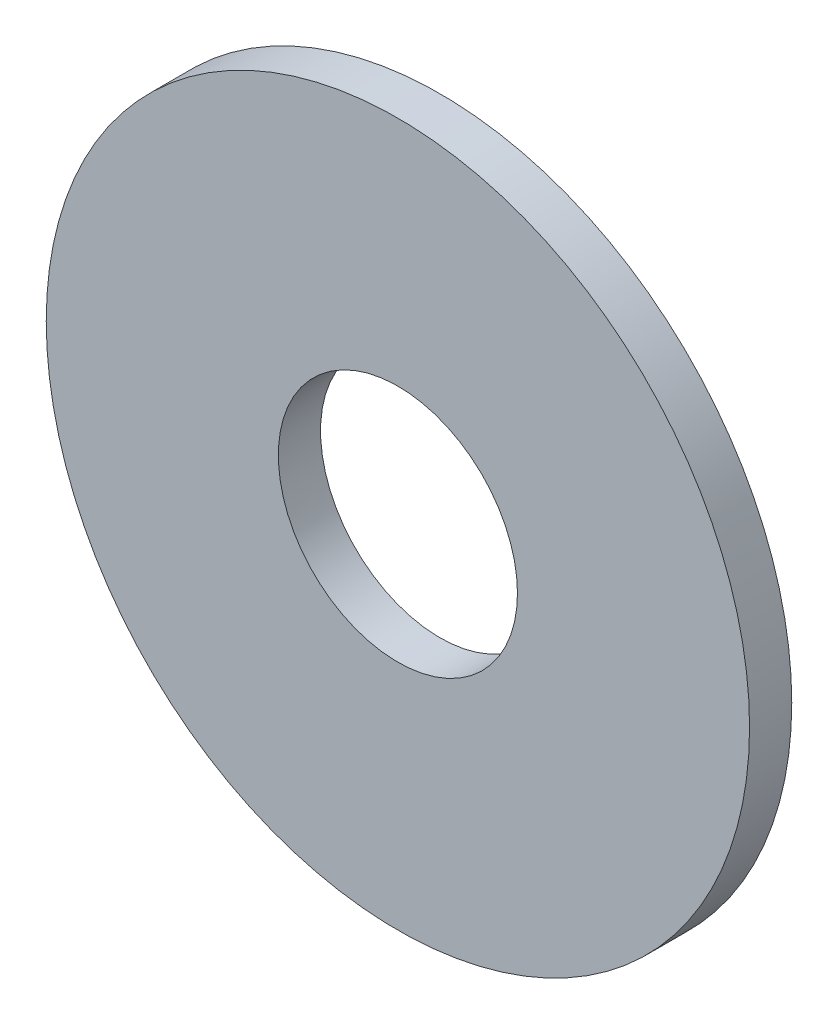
from build123d import *

# Parameters (mm, degrees)
SCHIZZO1_R                   = 25
SCHIZZO1_R_2                 = 8.5
ESTRUSIONE_ESTRUSIONE1_DEPTH = 3


with BuildPart() as part:
    # Schizzo1 → Estrusione-Estrusione1 (new body)
    with BuildSketch(Plane.XY):
        Circle(SCHIZZO1_R)
        Circle(SCHIZZO1_R_2, mode=Mode.SUBTRACT)
    extrude(amount=ESTRUSIONE_ESTRUSIONE1_DEPTH)


solid = part.part
